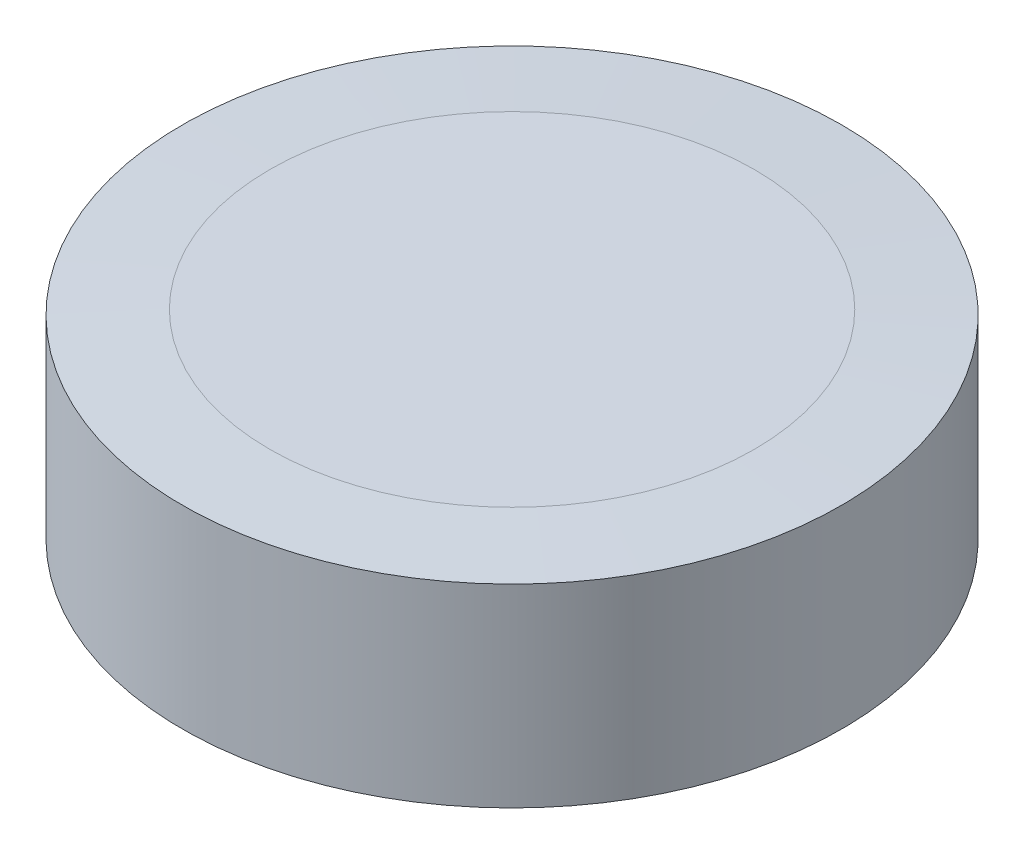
from build123d import *


with BuildPart() as part:
    # Sketch1 → Revolve1 (revolve)
    with BuildSketch(Plane.XY, mode=Mode.PRIVATE) as revolve1_sk:
        Polygon((0, -5.25), (-12.5, -5.25), (-17, -5), (-17, 5), (-12.5, 5.25), (0, 5.25), align=None)
    revolve(revolve1_sk.sketch.rotate(Axis((0, -5.25, 0), (0, 1, 0)), 270), axis=Axis((0, -5.25, 0), (0, 1, 0)))


solid = part.part
